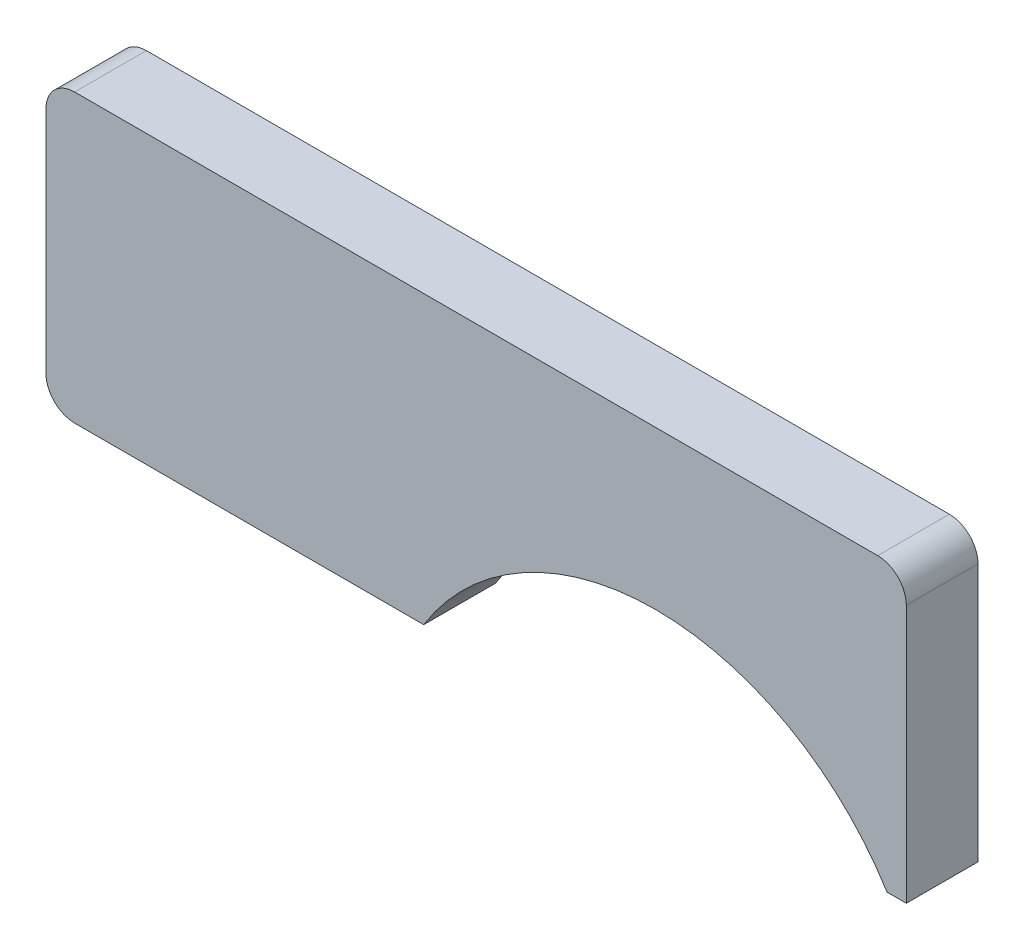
from build123d import *

# Parameters (mm, degrees)
EXTRUDE1_DEPTH = 3.175
FILLET1_R      = 2.54


with BuildPart() as part:
    # Sketch1 → Extrude1 (new, symmetric)
    with BuildSketch(Plane.XY):
        with BuildLine():
            Line((-53.975, 12.7), (-53.975, 38.1))
            Line((-53.975, 38.1), (22.225, 38.1))
            Line((22.225, 38.1), (22.225, 12.7))
            Line((22.225, 12.7), (20.517477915, 12.7))
            ThreePointArc((20.517477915, 12.7), (0, 24.13), (-20.517477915, 12.7))
            Line((-20.517477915, 12.7), (-53.975, 12.7))
        make_face()
    extrude(amount=EXTRUDE1_DEPTH, both=True)

    # Fillet1
    fillet1_edges = [part.edges().sort_by_distance(p)[0] for p in [
        (-53.975, 38.1, 0),
        (22.225, 38.1, 0),
        (-53.975, 12.7, 0),
    ]]
    fillet(fillet1_edges, radius=FILLET1_R)


solid = part.part
